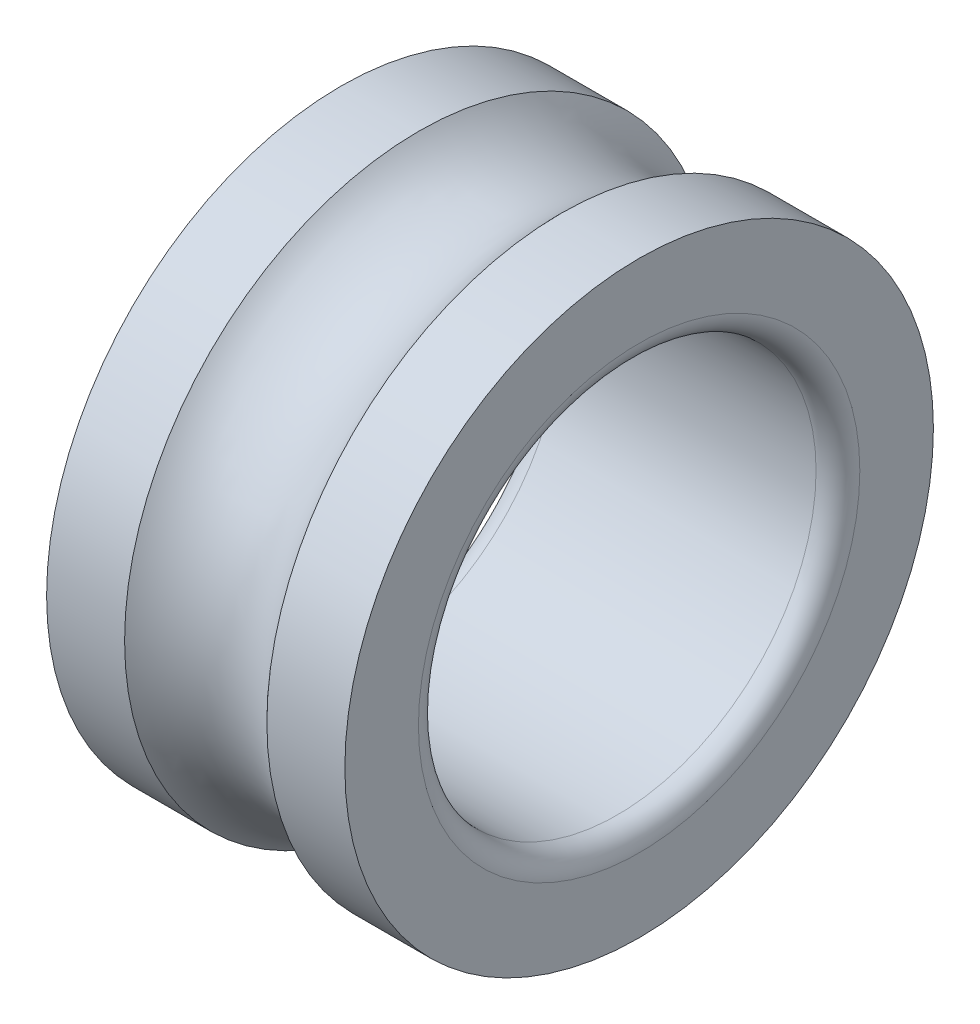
from build123d import *


with BuildPart() as part:
    # Esquisse1 → Base-R_volution (revolve)
    with BuildSketch(Plane(origin=(0, 0, 0), x_dir=(1, 0, 0), z_dir=(0, 1, 0)), mode=Mode.PRIVATE) as base_r_volution_sk:
        with BuildLine():
            Line((0, 14.8), (0, 11.1))
            ThreePointArc((0, 11.1), (0.322182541, 10.322182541), (1.1, 10))
            Line((1.1, 10), (13.9, 10))
            ThreePointArc((13.9, 10), (14.677817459, 10.322182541), (15, 11.1))
            Line((15, 11.1), (15, 14.8))
            Line((15, 14.8), (11.077708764, 14.8))
            ThreePointArc((11.077708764, 14.8), (7.5, 13.2), (3.922291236, 14.8))
            Line((3.922291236, 14.8), (0, 14.8))
        make_face()
    revolve(base_r_volution_sk.sketch.rotate(Axis((0, 0, 0), (1, 0, 0)), 180), axis=Axis((0, 0, 0), (1, 0, 0)))


solid = part.part
